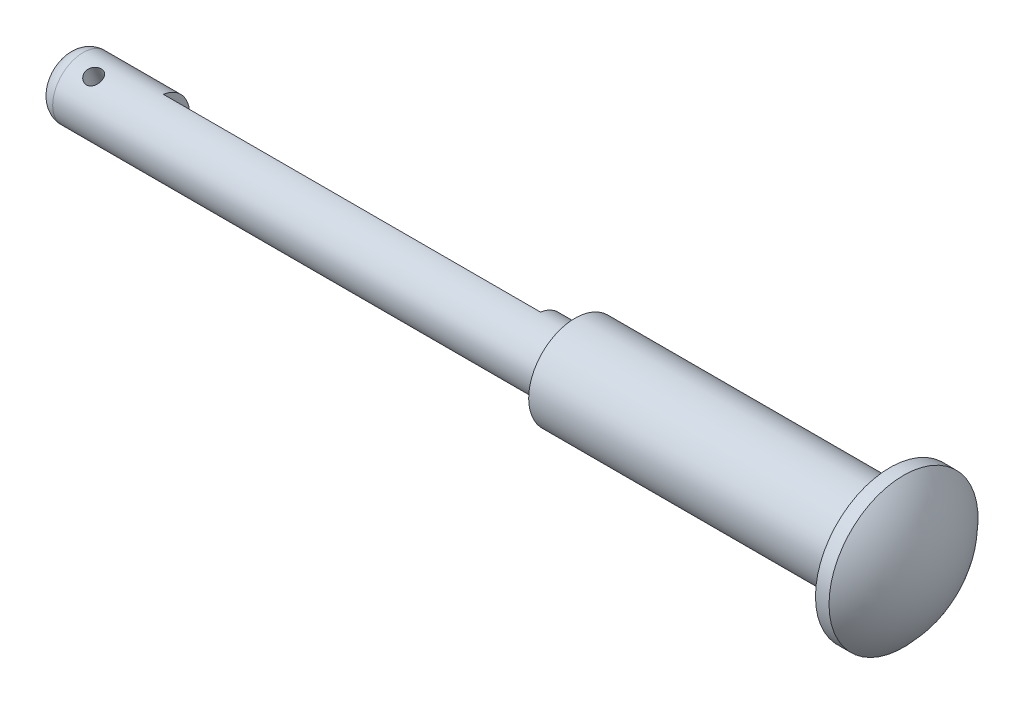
ISO-10303-21;
HEADER;
FILE_DESCRIPTION(('STEP AP214'),'2;1');
FILE_NAME('part.step','',(''),(''),'','','');
FILE_SCHEMA(('AUTOMOTIVE_DESIGN { 1 0 10303 214 1 1 1 1 }'));
ENDSEC;
DATA;
#1=APPLICATION_CONTEXT('core data for automotive mechanical design processes');
#2=APPLICATION_PROTOCOL_DEFINITION('international standard','automotive_design',2000,#1);
#3=PRODUCT_CONTEXT('',#1,'mechanical');
#4=PRODUCT('Part','Part','',(#3));
#5=PRODUCT_RELATED_PRODUCT_CATEGORY('part','',(#4));
#6=PRODUCT_DEFINITION_FORMATION('','',#4);
#7=PRODUCT_DEFINITION_CONTEXT('part definition',#1,'design');
#8=PRODUCT_DEFINITION('design','',#6,#7);
#9=PRODUCT_DEFINITION_SHAPE('','',#8);
#10=(LENGTH_UNIT() NAMED_UNIT(*) SI_UNIT(.MILLI.,.METRE.));
#11=(NAMED_UNIT(*) PLANE_ANGLE_UNIT() SI_UNIT($,.RADIAN.));
#12=(NAMED_UNIT(*) SI_UNIT($,.STERADIAN.) SOLID_ANGLE_UNIT());
#13=UNCERTAINTY_MEASURE_WITH_UNIT(LENGTH_MEASURE(1.E-05),#10,'distance_accuracy_value','');
#14=(GEOMETRIC_REPRESENTATION_CONTEXT(3) GLOBAL_UNCERTAINTY_ASSIGNED_CONTEXT((#13)) GLOBAL_UNIT_ASSIGNED_CONTEXT((#10,
#11,#12)) REPRESENTATION_CONTEXT('',''));
#15=CARTESIAN_POINT('',(0.,0.,0.));
#16=DIRECTION('',(0.,0.,1.));
#17=DIRECTION('',(1.,0.,0.));
#18=AXIS2_PLACEMENT_3D('',#15,#16,#17);
#19=CARTESIAN_POINT('',(-68.6445910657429,153.686378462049,0.));
#20=DIRECTION('',(1.,0.,0.));
#21=DIRECTION('',(0.,0.,-1.));
#22=AXIS2_PLACEMENT_3D('',#19,#20,#21);
#23=PLANE('',#22);
#24=CARTESIAN_POINT('',(-68.6445910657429,151.804700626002,0.));
#25=DIRECTION('',(-1.,0.,0.));
#26=DIRECTION('',(0.,0.,1.));
#27=AXIS2_PLACEMENT_3D('',#24,#25,#26);
#28=CIRCLE('',#27,1.88167783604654);
#29=CARTESIAN_POINT('',(-68.6445910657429,151.804700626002,1.88167783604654));
#30=VERTEX_POINT('',#29);
#31=EDGE_CURVE('E106',#30,#30,#28,.T.);
#32=ORIENTED_EDGE('',*,*,#31,.F.);
#33=EDGE_LOOP('',(#32));
#34=FACE_BOUND('',#33,.T.);
#35=CARTESIAN_POINT('',(-68.6445910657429,151.804700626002,0.));
#36=DIRECTION('',(-1.,0.,0.));
#37=DIRECTION('',(0.,0.,1.));
#38=AXIS2_PLACEMENT_3D('',#35,#36,#37);
#39=CIRCLE('',#38,2.85736263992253);
#40=CARTESIAN_POINT('',(-68.6445910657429,151.804700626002,2.85736263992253));
#41=VERTEX_POINT('',#40);
#42=EDGE_CURVE('E109',#41,#41,#39,.T.);
#43=ORIENTED_EDGE('',*,*,#42,.T.);
#44=EDGE_LOOP('',(#43));
#45=FACE_BOUND('',#44,.T.);
#46=ADVANCED_FACE('F34',(#34,#45),#23,.F.);
#47=CARTESIAN_POINT('',(-100.,151.804700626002,0.));
#48=DIRECTION('',(-1.,0.,0.));
#49=DIRECTION('',(0.,0.,1.));
#50=AXIS2_PLACEMENT_3D('',#47,#48,#49);
#51=CYLINDRICAL_SURFACE('',#50,2.85736263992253);
#52=ORIENTED_EDGE('',*,*,#42,.F.);
#53=EDGE_LOOP('',(#52));
#54=FACE_BOUND('',#53,.T.);
#55=CARTESIAN_POINT('',(-49.2005867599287,151.804700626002,0.));
#56=DIRECTION('',(-1.,0.,0.));
#57=DIRECTION('',(0.,0.,1.));
#58=AXIS2_PLACEMENT_3D('',#55,#56,#57);
#59=CIRCLE('',#58,2.85736263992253);
#60=CARTESIAN_POINT('',(-49.2005867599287,151.804700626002,2.85736263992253));
#61=VERTEX_POINT('',#60);
#62=EDGE_CURVE('E110',#61,#61,#59,.T.);
#63=ORIENTED_EDGE('',*,*,#62,.T.);
#64=EDGE_LOOP('',(#63));
#65=FACE_BOUND('',#64,.T.);
#66=ADVANCED_FACE('F96',(#54,#65),#51,.T.);
#67=CARTESIAN_POINT('',(-49.2005867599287,154.662063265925,0.));
#68=DIRECTION('',(1.,0.,0.));
#69=DIRECTION('',(0.,0.,-1.));
#70=AXIS2_PLACEMENT_3D('',#67,#68,#69);
#71=PLANE('',#70);
#72=ORIENTED_EDGE('',*,*,#62,.F.);
#73=EDGE_LOOP('',(#72));
#74=FACE_BOUND('',#73,.T.);
#75=CARTESIAN_POINT('',(-49.2005867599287,151.804700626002,0.));
#76=DIRECTION('',(-1.,0.,0.));
#77=DIRECTION('',(0.,0.,1.));
#78=AXIS2_PLACEMENT_3D('',#75,#76,#77);
#79=CIRCLE('',#78,4.5996569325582);
#80=CARTESIAN_POINT('',(-49.2005867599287,151.804700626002,4.5996569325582));
#81=VERTEX_POINT('',#80);
#82=EDGE_CURVE('E113',#81,#81,#79,.T.);
#83=ORIENTED_EDGE('',*,*,#82,.T.);
#84=EDGE_LOOP('',(#83));
#85=FACE_BOUND('',#84,.T.);
#86=ADVANCED_FACE('F101',(#74,#85),#71,.F.);
#87=CARTESIAN_POINT('',(-100.,151.804700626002,0.));
#88=DIRECTION('',(-1.,0.,0.));
#89=DIRECTION('',(0.,0.,1.));
#90=AXIS2_PLACEMENT_3D('',#87,#88,#89);
#91=CYLINDRICAL_SURFACE('',#90,4.5996569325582);
#92=ORIENTED_EDGE('',*,*,#82,.F.);
#93=EDGE_LOOP('',(#92));
#94=FACE_BOUND('',#93,.T.);
#95=CARTESIAN_POINT('',(-48.3642854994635,151.804700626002,0.));
#96=DIRECTION('',(-1.,0.,0.));
#97=DIRECTION('',(0.,0.,1.));
#98=AXIS2_PLACEMENT_3D('',#95,#96,#97);
#99=CIRCLE('',#98,4.5996569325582);
#100=CARTESIAN_POINT('',(-48.3642854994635,151.804700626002,4.5996569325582));
#101=VERTEX_POINT('',#100);
#102=EDGE_CURVE('E224',#101,#101,#99,.T.);
#103=ORIENTED_EDGE('',*,*,#102,.T.);
#104=EDGE_LOOP('',(#103));
#105=FACE_BOUND('',#104,.T.);
#106=ADVANCED_FACE('F185',(#94,#105),#91,.T.);
#107=CARTESIAN_POINT('',(-52.9639424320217,151.804700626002,0.));
#108=DIRECTION('',(-1.,0.,0.));
#109=DIRECTION('',(0.,1.,0.));
#110=AXIS2_PLACEMENT_3D('',#107,#108,#109);
#111=SPHERICAL_SURFACE('',#110,6.50489721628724);
#112=ORIENTED_EDGE('',*,*,#102,.F.);
#113=EDGE_LOOP('',(#112));
#114=FACE_BOUND('',#113,.T.);
#115=ADVANCED_FACE('F178',(#114),#111,.T.);
#116=CARTESIAN_POINT('',(-100.,153.686378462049,0.));
#117=DIRECTION('',(1.,0.,0.));
#118=DIRECTION('',(0.,0.,-1.));
#119=AXIS2_PLACEMENT_3D('',#116,#117,#118);
#120=PLANE('',#119);
#121=CARTESIAN_POINT('',(-100.,151.804700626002,0.));
#122=DIRECTION('',(1.,0.,0.));
#123=DIRECTION('',(0.,0.,-1.));
#124=AXIS2_PLACEMENT_3D('',#121,#122,#123);
#125=CIRCLE('',#124,0.881677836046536);
#126=CARTESIAN_POINT('',(-100.,151.804700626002,-0.881677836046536));
#127=VERTEX_POINT('',#126);
#128=EDGE_CURVE('E41',#127,#127,#125,.F.);
#129=ORIENTED_EDGE('',*,*,#128,.T.);
#130=EDGE_LOOP('',(#129));
#131=FACE_BOUND('',#130,.T.);
#132=ADVANCED_FACE('F83',(#131),#120,.F.);
#133=CARTESIAN_POINT('',(-100.,151.804700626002,0.));
#134=DIRECTION('',(-1.,0.,0.));
#135=DIRECTION('',(0.,0.,1.));
#136=AXIS2_PLACEMENT_3D('',#133,#134,#135);
#137=CYLINDRICAL_SURFACE('',#136,1.88167783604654);
#138=CARTESIAN_POINT('',(-99.0000000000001,151.804700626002,0.));
#139=DIRECTION('',(1.,0.,0.));
#140=DIRECTION('',(0.,0.,-1.));
#141=AXIS2_PLACEMENT_3D('',#138,#139,#140);
#142=CIRCLE('',#141,1.88167783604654);
#143=CARTESIAN_POINT('',(-99.0000000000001,151.804700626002,-1.88167783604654));
#144=VERTEX_POINT('',#143);
#145=EDGE_CURVE('E11',#144,#144,#142,.T.);
#146=ORIENTED_EDGE('',*,*,#145,.T.);
#147=EDGE_LOOP('',(#146));
#148=FACE_BOUND('',#147,.T.);
#149=CARTESIAN_POINT('',(-71.0310243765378,151.804700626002,0.));
#150=DIRECTION('',(-1.,0.,0.));
#151=DIRECTION('',(0.,0.,1.));
#152=AXIS2_PLACEMENT_3D('',#149,#150,#151);
#153=CIRCLE('',#152,1.88167783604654);
#154=CARTESIAN_POINT('',(-71.0310243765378,153.668696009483,-0.257357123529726));
#155=VERTEX_POINT('',#154);
#156=CARTESIAN_POINT('',(-71.0310243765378,150.761883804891,-1.56628367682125));
#157=VERTEX_POINT('',#156);
#158=EDGE_CURVE('E66',#155,#157,#153,.T.);
#159=ORIENTED_EDGE('',*,*,#158,.F.);
#160=DIRECTION('',(-1.,0.,0.));
#161=VECTOR('',#160,1.);
#162=CARTESIAN_POINT('',(-100.,153.668696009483,-0.257357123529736));
#163=LINE('',#162,#161);
#164=CARTESIAN_POINT('',(-94.309573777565,153.668696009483,-0.257357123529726));
#165=VERTEX_POINT('',#164);
#166=EDGE_CURVE('E61',#155,#165,#163,.T.);
#167=ORIENTED_EDGE('',*,*,#166,.T.);
#168=CARTESIAN_POINT('',(-94.309573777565,151.804700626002,0.));
#169=DIRECTION('',(1.,0.,0.));
#170=DIRECTION('',(0.,0.,-1.));
#171=AXIS2_PLACEMENT_3D('',#168,#169,#170);
#172=CIRCLE('',#171,1.88167783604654);
#173=CARTESIAN_POINT('',(-94.309573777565,150.761883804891,-1.56628367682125));
#174=VERTEX_POINT('',#173);
#175=EDGE_CURVE('E55',#174,#165,#172,.T.);
#176=ORIENTED_EDGE('',*,*,#175,.F.);
#177=DIRECTION('',(-1.,0.,0.));
#178=VECTOR('',#177,1.);
#179=CARTESIAN_POINT('',(-100.,150.761883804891,-1.56628367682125));
#180=LINE('',#179,#178);
#181=EDGE_CURVE('E74',#174,#157,#180,.F.);
#182=ORIENTED_EDGE('',*,*,#181,.T.);
#183=EDGE_LOOP('',(#159,#167,#176,#182));
#184=FACE_BOUND('',#183,.T.);
#185=CARTESIAN_POINT('',(-97.5904638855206,149.945334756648,-0.288911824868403));
#186=CARTESIAN_POINT('',(-97.5629160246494,149.945334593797,-0.288912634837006));
#187=CARTESIAN_POINT('',(-97.535361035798,149.945694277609,-0.291255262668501));
#188=CARTESIAN_POINT('',(-97.4810465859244,149.947170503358,-0.300523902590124));
#189=CARTESIAN_POINT('',(-97.4542875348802,149.948287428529,-0.307452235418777));
#190=CARTESIAN_POINT('',(-97.4023585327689,149.951381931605,-0.325584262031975));
#191=CARTESIAN_POINT('',(-97.3771864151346,149.953358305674,-0.33678197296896));
#192=CARTESIAN_POINT('',(-97.3290446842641,149.958324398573,-0.363020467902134));
#193=CARTESIAN_POINT('',(-97.3060752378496,149.961314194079,-0.378061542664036));
#194=CARTESIAN_POINT('',(-97.2624203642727,149.968562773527,-0.411841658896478));
#195=CARTESIAN_POINT('',(-97.2417977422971,149.972848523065,-0.430656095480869));
#196=CARTESIAN_POINT('',(-97.2039770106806,149.982840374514,-0.471137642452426));
#197=CARTESIAN_POINT('',(-97.1867792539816,149.988546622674,-0.49280504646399));
#198=CARTESIAN_POINT('',(-97.1560348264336,150.001615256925,-0.538675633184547));
#199=CARTESIAN_POINT('',(-97.1425505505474,150.009002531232,-0.562913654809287));
#200=CARTESIAN_POINT('',(-97.1200227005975,150.025426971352,-0.61285116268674));
#201=CARTESIAN_POINT('',(-97.1109783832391,150.034463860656,-0.638550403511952));
#202=CARTESIAN_POINT('',(-97.0977903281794,150.053880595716,-0.689984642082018));
#203=CARTESIAN_POINT('',(-97.0935397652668,150.064225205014,-0.715705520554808));
#204=CARTESIAN_POINT('',(-97.089723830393,150.086189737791,-0.766947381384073));
#205=CARTESIAN_POINT('',(-97.0901576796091,150.097809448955,-0.792468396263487));
#206=CARTESIAN_POINT('',(-97.0956229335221,150.121662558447,-0.841920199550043));
#207=CARTESIAN_POINT('',(-97.1005389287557,150.133873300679,-0.865874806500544));
#208=CARTESIAN_POINT('',(-97.114642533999,150.158733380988,-0.912247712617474));
#209=CARTESIAN_POINT('',(-97.1238303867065,150.171382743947,-0.934665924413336));
#210=CARTESIAN_POINT('',(-97.1463056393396,150.196745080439,-0.977660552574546));
#211=CARTESIAN_POINT('',(-97.1596326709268,150.209457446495,-0.998216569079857));
#212=CARTESIAN_POINT('',(-97.1899775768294,150.234273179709,-1.03682038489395));
#213=CARTESIAN_POINT('',(-97.2069961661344,150.246376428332,-1.05486769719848));
#214=CARTESIAN_POINT('',(-97.2448540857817,150.269767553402,-1.08863546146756));
#215=CARTESIAN_POINT('',(-97.2657940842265,150.281019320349,-1.10426819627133));
#216=CARTESIAN_POINT('',(-97.31058180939,150.301687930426,-1.1322400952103));
#217=CARTESIAN_POINT('',(-97.3344297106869,150.3111046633,-1.14457906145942));
#218=CARTESIAN_POINT('',(-97.3845607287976,150.327604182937,-1.1657959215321));
#219=CARTESIAN_POINT('',(-97.4108577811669,150.334672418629,-1.17465229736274));
#220=CARTESIAN_POINT('',(-97.4650174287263,150.345931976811,-1.18860708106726));
#221=CARTESIAN_POINT('',(-97.4928796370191,150.350124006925,-1.19370641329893));
#222=CARTESIAN_POINT('',(-97.548492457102,150.35525990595,-1.19993708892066));
#223=CARTESIAN_POINT('',(-97.5762218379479,150.356296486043,-1.20118170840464));
#224=CARTESIAN_POINT('',(-97.6315452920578,150.355313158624,-1.19999502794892));
#225=CARTESIAN_POINT('',(-97.6591393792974,150.353293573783,-1.19756411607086));
#226=CARTESIAN_POINT('',(-97.7128654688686,150.34640468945,-1.18916470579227));
#227=CARTESIAN_POINT('',(-97.7390153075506,150.341590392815,-1.18326445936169));
#228=CARTESIAN_POINT('',(-97.7897099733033,150.329458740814,-1.1681038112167));
#229=CARTESIAN_POINT('',(-97.8142545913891,150.322141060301,-1.15884297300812));
#230=CARTESIAN_POINT('',(-97.8616339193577,150.305241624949,-1.13689465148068));
#231=CARTESIAN_POINT('',(-97.8844195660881,150.295613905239,-1.12413673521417));
#232=CARTESIAN_POINT('',(-97.9271039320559,150.274710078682,-1.0955153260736));
#233=CARTESIAN_POINT('',(-97.9470021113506,150.263433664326,-1.07965125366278));
#234=CARTESIAN_POINT('',(-97.9839326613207,150.239454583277,-1.0445952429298));
#235=CARTESIAN_POINT('',(-98.0008665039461,150.226720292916,-1.02532092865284));
#236=CARTESIAN_POINT('',(-98.0306658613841,150.20072487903,-0.984156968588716));
#237=CARTESIAN_POINT('',(-98.0435315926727,150.18746378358,-0.962267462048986));
#238=CARTESIAN_POINT('',(-98.0647117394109,150.161121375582,-0.916541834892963));
#239=CARTESIAN_POINT('',(-98.073060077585,150.148039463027,-0.892721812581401));
#240=CARTESIAN_POINT('',(-98.0850670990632,150.122500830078,-0.843611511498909));
#241=CARTESIAN_POINT('',(-98.0887268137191,150.110043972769,-0.818321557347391));
#242=CARTESIAN_POINT('',(-98.0911884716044,150.086573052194,-0.767790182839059));
#243=CARTESIAN_POINT('',(-98.0901349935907,150.075526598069,-0.742570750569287));
#244=CARTESIAN_POINT('',(-98.0835356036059,150.054746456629,-0.692181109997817));
#245=CARTESIAN_POINT('',(-98.0779898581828,150.045012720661,-0.667010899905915));
#246=CARTESIAN_POINT('',(-98.0626448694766,150.027086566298,-0.617644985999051));
#247=CARTESIAN_POINT('',(-98.0528747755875,150.018884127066,-0.593443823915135));
#248=CARTESIAN_POINT('',(-98.0293844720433,150.00397680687,-0.546544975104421));
#249=CARTESIAN_POINT('',(-98.0156637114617,149.997272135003,-0.523847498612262));
#250=CARTESIAN_POINT('',(-97.9842373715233,149.985140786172,-0.480045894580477));
#251=CARTESIAN_POINT('',(-97.9664358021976,149.979752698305,-0.45899995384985));
#252=CARTESIAN_POINT('',(-97.9275354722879,149.970348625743,-0.419845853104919));
#253=CARTESIAN_POINT('',(-97.9064358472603,149.966333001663,-0.401738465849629));
#254=CARTESIAN_POINT('',(-97.860985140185,149.959421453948,-0.368710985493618));
#255=CARTESIAN_POINT('',(-97.8365732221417,149.956551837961,-0.353868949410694));
#256=CARTESIAN_POINT('',(-97.7855331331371,149.951867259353,-0.328463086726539));
#257=CARTESIAN_POINT('',(-97.7589064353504,149.950051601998,-0.3178964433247));
#258=CARTESIAN_POINT('',(-97.7087230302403,149.947539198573,-0.302837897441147));
#259=CARTESIAN_POINT('',(-97.685385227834,149.94670721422,-0.297631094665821));
#260=CARTESIAN_POINT('',(-97.6381879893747,149.945605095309,-0.290667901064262));
#261=CARTESIAN_POINT('',(-97.6143286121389,149.945334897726,-0.288911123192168));
#262=CARTESIAN_POINT('',(-97.5904638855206,149.945334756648,-0.288911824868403));
#263=B_SPLINE_CURVE_WITH_KNOTS('',3,(#185,#186,#187,#188,#189,#190,#191,#192,#193,#194,#195,
#196,#197,#198,#199,#200,#201,#202,#203,#204,#205,#206,#207,#208,#209,#210,#211,#212,#213,#214,
#215,#216,#217,#218,#219,#220,#221,#222,#223,#224,#225,#226,#227,#228,#229,#230,#231,#232,#233,
#234,#235,#236,#237,#238,#239,#240,#241,#242,#243,#244,#245,#246,#247,#248,#249,#250,#251,#252,
#253,#254,#255,#256,#257,#258,#259,#260,#261,#262),.UNSPECIFIED.,.T.,.F.,(4,2,2,2,2,2,2,2,2,2,2,
2,2,2,2,2,2,2,2,2,2,2,2,2,2,2,2,2,2,2,2,2,2,2,2,2,2,2,4),(0.,0.0825558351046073,
0.165153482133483,0.247635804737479,0.330124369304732,0.414463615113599,0.498811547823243,
0.584500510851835,0.670175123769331,0.753900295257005,0.837611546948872,0.919226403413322,
1.00084589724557,1.08327231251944,1.1657147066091,1.25067061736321,1.33563163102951,
1.4211096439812,1.50656661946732,1.58948727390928,1.67239917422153,1.75373208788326,
1.83507556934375,1.91819592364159,2.00133180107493,2.08685138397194,2.17236641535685,
2.25723004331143,2.34207500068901,2.42433546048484,2.50659287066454,2.58829151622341,
2.670001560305,2.75387761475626,2.83777569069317,2.92350208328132,3.0091719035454,
3.08069809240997,3.15221625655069),.UNSPECIFIED.);
#264=CARTESIAN_POINT('',(-97.5904638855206,149.945334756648,-0.288911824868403));
#265=VERTEX_POINT('',#264);
#266=EDGE_CURVE('E124',#265,#265,#263,.T.);
#267=ORIENTED_EDGE('',*,*,#266,.T.);
#268=EDGE_LOOP('',(#267));
#269=FACE_BOUND('',#268,.T.);
#270=CARTESIAN_POINT('',(-97.5904638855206,153.253477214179,1.20073222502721));
#271=CARTESIAN_POINT('',(-97.6180117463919,153.2534779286,1.20073181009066));
#272=CARTESIAN_POINT('',(-97.6455667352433,153.254993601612,1.19890971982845));
#273=CARTESIAN_POINT('',(-97.6998811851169,153.260955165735,1.19166081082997));
#274=CARTESIAN_POINT('',(-97.7266402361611,153.26540254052,1.18623216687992));
#275=CARTESIAN_POINT('',(-97.7785692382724,153.276928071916,1.17189660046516));
#276=CARTESIAN_POINT('',(-97.8037413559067,153.284002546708,1.16299454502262));
#277=CARTESIAN_POINT('',(-97.8518830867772,153.30035738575,1.14188435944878));
#278=CARTESIAN_POINT('',(-97.8748525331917,153.309637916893,1.1296759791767));
#279=CARTESIAN_POINT('',(-97.9185074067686,153.330126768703,1.1018579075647));
#280=CARTESIAN_POINT('',(-97.9391300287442,153.341373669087,1.0861780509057));
#281=CARTESIAN_POINT('',(-97.9769507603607,153.365062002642,1.05186397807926));
#282=CARTESIAN_POINT('',(-97.9941485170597,153.377503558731,1.03322945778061));
#283=CARTESIAN_POINT('',(-98.0248929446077,153.403187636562,0.993039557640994));
#284=CARTESIAN_POINT('',(-98.0383772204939,153.416439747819,0.971442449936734));
#285=CARTESIAN_POINT('',(-98.0609050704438,153.442944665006,0.926044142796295));
#286=CARTESIAN_POINT('',(-98.0699493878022,153.456197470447,0.90224331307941));
#287=CARTESIAN_POINT('',(-98.0831374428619,153.481839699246,0.853612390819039));
#288=CARTESIAN_POINT('',(-98.0873880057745,153.494241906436,0.828818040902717));
#289=CARTESIAN_POINT('',(-98.0912039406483,153.518051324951,0.77840692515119));
#290=CARTESIAN_POINT('',(-98.0907700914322,153.529458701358,0.752790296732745));
#291=CARTESIAN_POINT('',(-98.0853048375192,153.550675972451,0.702151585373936));
#292=CARTESIAN_POINT('',(-98.0803888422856,153.560518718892,0.677130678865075));
#293=CARTESIAN_POINT('',(-98.0662852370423,153.578763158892,0.627778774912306));
#294=CARTESIAN_POINT('',(-98.0570973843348,153.58716477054,0.60344781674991));
#295=CARTESIAN_POINT('',(-98.0346221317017,153.602546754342,0.555959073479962));
#296=CARTESIAN_POINT('',(-98.0212951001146,153.609512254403,0.532815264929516));
#297=CARTESIAN_POINT('',(-97.9909501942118,153.621968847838,0.488646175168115));
#298=CARTESIAN_POINT('',(-97.9739316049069,153.62745965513,0.467621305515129));
#299=CARTESIAN_POINT('',(-97.9360736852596,153.637239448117,0.427724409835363));
#300=CARTESIAN_POINT('',(-97.9151336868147,153.64148668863,0.408937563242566));
#301=CARTESIAN_POINT('',(-97.8703459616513,153.64873129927,0.37492088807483));
#302=CARTESIAN_POINT('',(-97.8464980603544,153.651728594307,0.359691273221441));
#303=CARTESIAN_POINT('',(-97.7963670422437,153.656678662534,0.33327373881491));
#304=CARTESIAN_POINT('',(-97.7700699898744,153.65862496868,0.32211097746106));
#305=CARTESIAN_POINT('',(-97.715910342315,153.661610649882,0.304430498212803));
#306=CARTESIAN_POINT('',(-97.6880481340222,153.66265024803,0.29791163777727));
#307=CARTESIAN_POINT('',(-97.6324353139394,153.663911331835,0.289936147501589));
#308=CARTESIAN_POINT('',(-97.6047059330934,153.664156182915,0.288335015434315));
#309=CARTESIAN_POINT('',(-97.5493824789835,153.663919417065,0.289857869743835));
#310=CARTESIAN_POINT('',(-97.5217883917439,153.663437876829,0.292981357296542));
#311=CARTESIAN_POINT('',(-97.4680623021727,153.661714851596,0.303706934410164));
#312=CARTESIAN_POINT('',(-97.4419124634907,153.660488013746,0.31122259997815));
#313=CARTESIAN_POINT('',(-97.3912177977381,153.657177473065,0.330355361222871));
#314=CARTESIAN_POINT('',(-97.3666731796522,153.65509365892,0.341972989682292));
#315=CARTESIAN_POINT('',(-97.3192938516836,153.649860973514,0.369174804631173));
#316=CARTESIAN_POINT('',(-97.2965082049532,153.646689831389,0.384840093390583));
#317=CARTESIAN_POINT('',(-97.2538238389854,153.639114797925,0.419463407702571));
#318=CARTESIAN_POINT('',(-97.2339256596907,153.634710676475,0.438422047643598));
#319=CARTESIAN_POINT('',(-97.1969951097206,153.624356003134,0.479613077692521));
#320=CARTESIAN_POINT('',(-97.1800612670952,153.618364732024,0.501923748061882));
#321=CARTESIAN_POINT('',(-97.1502619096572,153.604773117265,0.548673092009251));
#322=CARTESIAN_POINT('',(-97.1373961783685,153.597172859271,0.573111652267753));
#323=CARTESIAN_POINT('',(-97.1162160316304,153.580395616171,0.623144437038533));
#324=CARTESIAN_POINT('',(-97.1078676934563,153.571231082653,0.648728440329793));
#325=CARTESIAN_POINT('',(-97.0958606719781,153.55138673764,0.700402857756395));
#326=CARTESIAN_POINT('',(-97.0922009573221,153.54070725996,0.726493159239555));
#327=CARTESIAN_POINT('',(-97.0897392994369,153.518428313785,0.777561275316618));
#328=CARTESIAN_POINT('',(-97.0907927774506,153.506866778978,0.80254876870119));
#329=CARTESIAN_POINT('',(-97.0973921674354,153.482910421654,0.851508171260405));
#330=CARTESIAN_POINT('',(-97.1029379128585,153.470515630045,0.87548011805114));
#331=CARTESIAN_POINT('',(-97.1182829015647,153.445434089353,0.92162398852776));
#332=CARTESIAN_POINT('',(-97.1280529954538,153.432749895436,0.943807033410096));
#333=CARTESIAN_POINT('',(-97.151543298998,153.407514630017,0.986055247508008));
#334=CARTESIAN_POINT('',(-97.1652640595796,153.394963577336,1.00612012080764));
#335=CARTESIAN_POINT('',(-97.196690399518,153.370207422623,1.04423682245));
#336=CARTESIAN_POINT('',(-97.2144919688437,153.358020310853,1.06222118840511));
#337=CARTESIAN_POINT('',(-97.2533922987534,153.334936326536,1.09521527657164));
#338=CARTESIAN_POINT('',(-97.274491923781,153.324039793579,1.11022421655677));
#339=CARTESIAN_POINT('',(-97.3199426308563,153.303891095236,1.13729105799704));
#340=CARTESIAN_POINT('',(-97.3443545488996,153.294679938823,1.14927752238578));
#341=CARTESIAN_POINT('',(-97.3953946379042,153.278761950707,1.16962502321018));
#342=CARTESIAN_POINT('',(-97.4220213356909,153.272053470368,1.17798844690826));
#343=CARTESIAN_POINT('',(-97.472204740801,153.26244342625,1.18985095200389));
#344=CARTESIAN_POINT('',(-97.4955425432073,153.259096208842,1.19392515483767));
#345=CARTESIAN_POINT('',(-97.5427397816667,153.254612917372,1.1993658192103));
#346=CARTESIAN_POINT('',(-97.5665991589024,153.253476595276,1.20073258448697));
#347=CARTESIAN_POINT('',(-97.5904638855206,153.253477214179,1.20073222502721));
#348=B_SPLINE_CURVE_WITH_KNOTS('',3,(#270,#271,#272,#273,#274,#275,#276,#277,#278,#279,#280,
#281,#282,#283,#284,#285,#286,#287,#288,#289,#290,#291,#292,#293,#294,#295,#296,#297,#298,#299,
#300,#301,#302,#303,#304,#305,#306,#307,#308,#309,#310,#311,#312,#313,#314,#315,#316,#317,#318,
#319,#320,#321,#322,#323,#324,#325,#326,#327,#328,#329,#330,#331,#332,#333,#334,#335,#336,#337,
#338,#339,#340,#341,#342,#343,#344,#345,#346,#347),.UNSPECIFIED.,.T.,.F.,(4,2,2,2,2,2,2,2,2,2,2,
2,2,2,2,2,2,2,2,2,2,2,2,2,2,2,2,2,2,2,2,2,2,2,2,2,2,2,4),(0.,0.0825558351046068,
0.165153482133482,0.247635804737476,0.330124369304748,0.414463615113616,0.498811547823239,
0.584500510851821,0.670175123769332,0.753900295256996,0.837611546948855,0.919226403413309,
1.00084589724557,1.08327231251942,1.16571470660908,1.25067061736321,1.33563163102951,
1.4211096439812,1.5065666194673,1.58948727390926,1.67239917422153,1.75373208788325,
1.83507556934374,1.91819592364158,2.00133180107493,2.08685138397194,2.17236641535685,
2.25723004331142,2.34207500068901,2.42433546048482,2.50659287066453,2.58829151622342,
2.67000156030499,2.75387761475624,2.83777569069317,2.92350208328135,3.00917190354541,
3.08069809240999,3.15221625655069),.UNSPECIFIED.);
#349=CARTESIAN_POINT('',(-97.5904638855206,153.253477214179,1.20073222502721));
#350=VERTEX_POINT('',#349);
#351=EDGE_CURVE('E117',#350,#350,#348,.T.);
#352=ORIENTED_EDGE('',*,*,#351,.T.);
#353=EDGE_LOOP('',(#352));
#354=FACE_BOUND('',#353,.T.);
#355=ORIENTED_EDGE('',*,*,#31,.T.);
#356=EDGE_LOOP('',(#355));
#357=FACE_BOUND('',#356,.T.);
#358=ADVANCED_FACE('F72',(#148,#184,#269,#354,#357),#137,.T.);
#359=CARTESIAN_POINT('',(-97.5904638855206,146.258433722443,-2.49746303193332));
#360=DIRECTION('',(0.,0.911820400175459,0.410589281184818));
#361=DIRECTION('',(0.,-0.410589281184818,0.911820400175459));
#362=AXIS2_PLACEMENT_3D('',#359,#360,#361);
#363=CYLINDRICAL_SURFACE('',#362,0.5);
#364=ORIENTED_EDGE('',*,*,#351,.F.);
#365=EDGE_LOOP('',(#364));
#366=FACE_BOUND('',#365,.T.);
#367=ORIENTED_EDGE('',*,*,#266,.F.);
#368=EDGE_LOOP('',(#367));
#369=FACE_BOUND('',#368,.T.);
#370=ADVANCED_FACE('F129',(#366,#369),#363,.F.);
#371=CARTESIAN_POINT('',(-71.0310243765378,151.807606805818,-6.66955642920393));
#372=DIRECTION('',(-1.,0.,0.));
#373=DIRECTION('',(0.,0.,1.));
#374=AXIS2_PLACEMENT_3D('',#371,#372,#373);
#375=PLANE('',#374);
#376=ORIENTED_EDGE('',*,*,#158,.T.);
#377=DIRECTION('',(0.,-0.91182040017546,-0.410589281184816));
#378=VECTOR('',#377,1.);
#379=CARTESIAN_POINT('',(-71.0310243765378,149.720733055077,-2.03510992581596));
#380=LINE('',#379,#378);
#381=EDGE_CURVE('E48',#155,#157,#380,.T.);
#382=ORIENTED_EDGE('',*,*,#381,.F.);
#383=EDGE_LOOP('',(#376,#382));
#384=FACE_BOUND('',#383,.T.);
#385=ADVANCED_FACE('F69',(#384),#375,.T.);
#386=CARTESIAN_POINT('',(-94.309573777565,151.807606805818,-6.66955642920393));
#387=DIRECTION('',(1.,0.,0.));
#388=DIRECTION('',(0.,0.,-1.));
#389=AXIS2_PLACEMENT_3D('',#386,#387,#388);
#390=PLANE('',#389);
#391=ORIENTED_EDGE('',*,*,#175,.T.);
#392=DIRECTION('',(0.,0.91182040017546,0.410589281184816));
#393=VECTOR('',#392,1.);
#394=CARTESIAN_POINT('',(-94.309573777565,149.720733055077,-2.03510992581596));
#395=LINE('',#394,#393);
#396=EDGE_CURVE('E63',#174,#165,#395,.T.);
#397=ORIENTED_EDGE('',*,*,#396,.F.);
#398=EDGE_LOOP('',(#391,#397));
#399=FACE_BOUND('',#398,.T.);
#400=ADVANCED_FACE('F92',(#399),#390,.T.);
#401=CARTESIAN_POINT('',(-71.0310243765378,154.758514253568,0.233383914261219));
#402=DIRECTION('',(0.,-0.410589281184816,0.91182040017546));
#403=DIRECTION('',(0.,-0.91182040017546,-0.410589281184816));
#404=AXIS2_PLACEMENT_3D('',#401,#402,#403);
#405=PLANE('',#404);
#406=ORIENTED_EDGE('',*,*,#381,.T.);
#407=ORIENTED_EDGE('',*,*,#181,.F.);
#408=ORIENTED_EDGE('',*,*,#396,.T.);
#409=ORIENTED_EDGE('',*,*,#166,.F.);
#410=EDGE_LOOP('',(#406,#407,#408,#409));
#411=FACE_BOUND('',#410,.T.);
#412=ADVANCED_FACE('F62',(#411),#405,.F.);
#413=CARTESIAN_POINT('',(-99.0000000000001,151.804700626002,0.));
#414=DIRECTION('',(1.,0.,0.));
#415=DIRECTION('',(0.,0.,-1.));
#416=AXIS2_PLACEMENT_3D('',#413,#414,#415);
#417=DEGENERATE_TOROIDAL_SURFACE('',#416,0.881677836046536,1.,.T.);
#418=ORIENTED_EDGE('',*,*,#145,.F.);
#419=EDGE_LOOP('',(#418));
#420=FACE_BOUND('',#419,.T.);
#421=ORIENTED_EDGE('',*,*,#128,.F.);
#422=EDGE_LOOP('',(#421));
#423=FACE_BOUND('',#422,.T.);
#424=ADVANCED_FACE('F85',(#420,#423),#417,.T.);
#425=CLOSED_SHELL('',(#46,#66,#86,#106,#115,#132,#358,#370,#385,#400,#412,#424));
#426=MANIFOLD_SOLID_BREP('B2',#425);
#427=ADVANCED_BREP_SHAPE_REPRESENTATION('',(#18,#426),#14);
#428=SHAPE_DEFINITION_REPRESENTATION(#9,#427);
ENDSEC;
END-ISO-10303-21;
